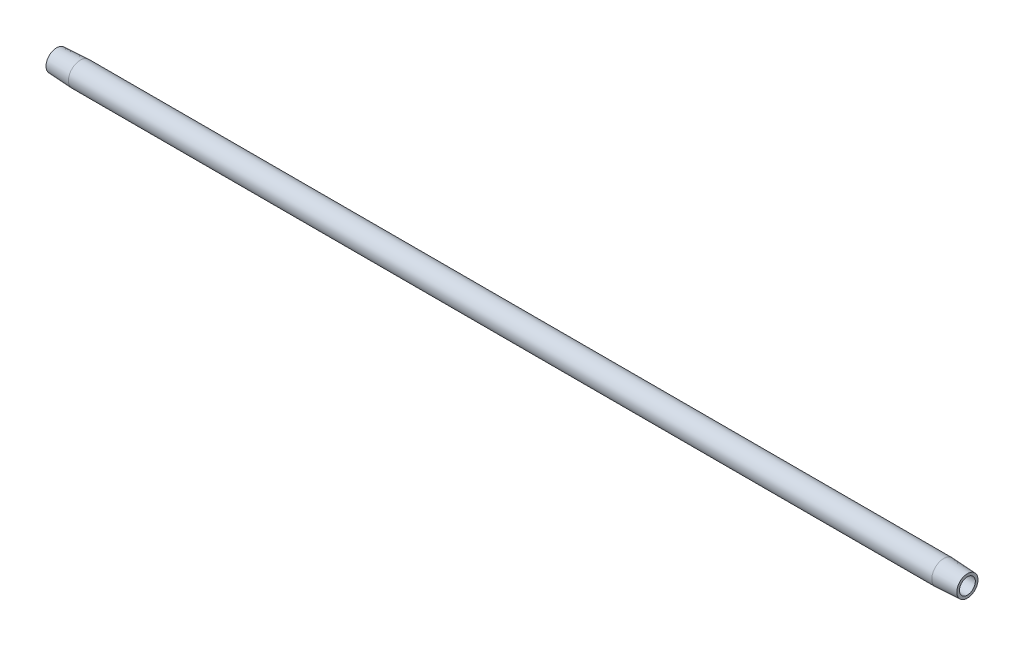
from build123d import *


with BuildPart() as part:
    # Sketch2 → Revolve1 (revolve)
    with BuildSketch(Plane.XY, mode=Mode.PRIVATE) as revolve1_sk:
        Polygon((7.9375, 3.96875), (0, 3.552763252), (0, 2.6543), (304.8, 2.6543), (304.8, 3.552763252), (296.8625, 3.96875), align=None)
    revolve(revolve1_sk.sketch.rotate(Axis((0.476141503, 0, 0), (1, 0, 0)), 90), axis=Axis((0.476141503, 0, 0), (1, 0, 0)))


solid = part.part
